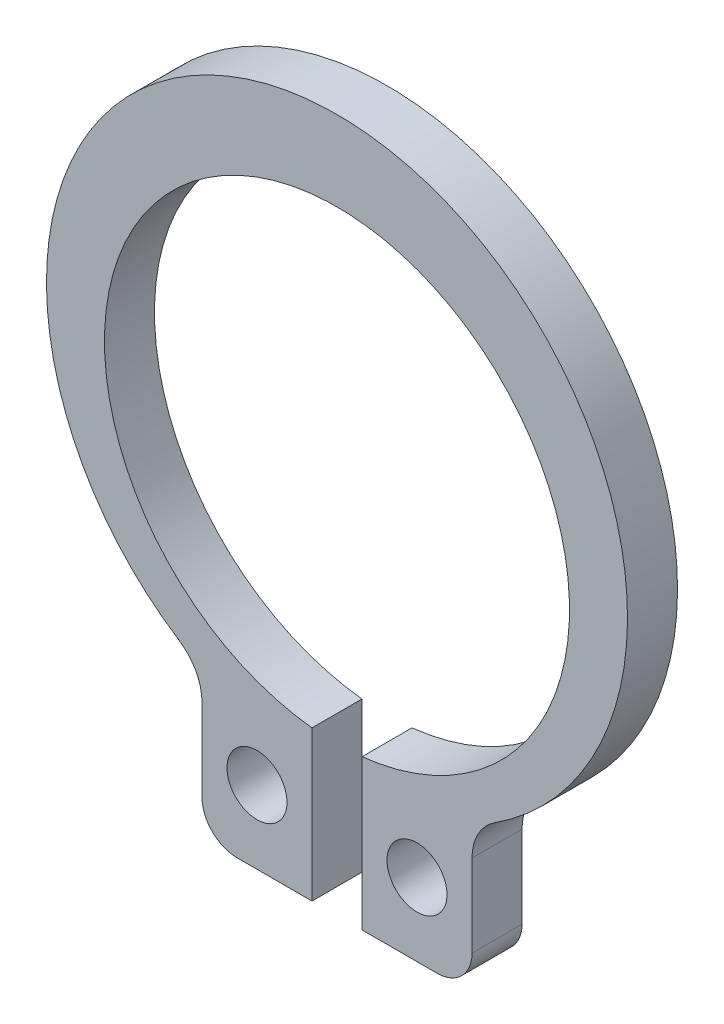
ISO-10303-21;
HEADER;
FILE_DESCRIPTION(('STEP AP214'),'2;1');
FILE_NAME('part.step','',(''),(''),'','','');
FILE_SCHEMA(('AUTOMOTIVE_DESIGN { 1 0 10303 214 1 1 1 1 }'));
ENDSEC;
DATA;
#1=APPLICATION_CONTEXT('core data for automotive mechanical design processes');
#2=APPLICATION_PROTOCOL_DEFINITION('international standard','automotive_design',2000,#1);
#3=PRODUCT_CONTEXT('',#1,'mechanical');
#4=PRODUCT('Part','Part','',(#3));
#5=PRODUCT_RELATED_PRODUCT_CATEGORY('part','',(#4));
#6=PRODUCT_DEFINITION_FORMATION('','',#4);
#7=PRODUCT_DEFINITION_CONTEXT('part definition',#1,'design');
#8=PRODUCT_DEFINITION('design','',#6,#7);
#9=PRODUCT_DEFINITION_SHAPE('','',#8);
#10=(LENGTH_UNIT() NAMED_UNIT(*) SI_UNIT(.MILLI.,.METRE.));
#11=(NAMED_UNIT(*) PLANE_ANGLE_UNIT() SI_UNIT($,.RADIAN.));
#12=(NAMED_UNIT(*) SI_UNIT($,.STERADIAN.) SOLID_ANGLE_UNIT());
#13=UNCERTAINTY_MEASURE_WITH_UNIT(LENGTH_MEASURE(1.E-05),#10,'distance_accuracy_value','');
#14=(GEOMETRIC_REPRESENTATION_CONTEXT(3) GLOBAL_UNCERTAINTY_ASSIGNED_CONTEXT((#13)) GLOBAL_UNIT_ASSIGNED_CONTEXT((#10,
#11,#12)) REPRESENTATION_CONTEXT('',''));
#15=CARTESIAN_POINT('',(0.,0.,0.));
#16=DIRECTION('',(0.,0.,1.));
#17=DIRECTION('',(1.,0.,0.));
#18=AXIS2_PLACEMENT_3D('',#15,#16,#17);
#19=CARTESIAN_POINT('',(0.,0.,1.));
#20=DIRECTION('',(0.,0.,1.));
#21=DIRECTION('',(1.,0.,0.));
#22=AXIS2_PLACEMENT_3D('',#19,#20,#21);
#23=PLANE('',#22);
#24=CARTESIAN_POINT('',(-1.6,-6.16378074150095,1.));
#25=DIRECTION('',(0.,0.,1.));
#26=DIRECTION('',(1.,0.,0.));
#27=AXIS2_PLACEMENT_3D('',#24,#25,#26);
#28=CIRCLE('',#27,0.6);
#29=CARTESIAN_POINT('',(-1.,-6.16378074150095,1.));
#30=VERTEX_POINT('',#29);
#31=EDGE_CURVE('E216',#30,#30,#28,.T.);
#32=ORIENTED_EDGE('',*,*,#31,.F.);
#33=EDGE_LOOP('',(#32));
#34=FACE_BOUND('',#33,.T.);
#35=DIRECTION('',(1.,0.,0.));
#36=VECTOR('',#35,1.);
#37=CARTESIAN_POINT('',(0.499999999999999,-7.62304012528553,1.));
#38=LINE('',#37,#36);
#39=CARTESIAN_POINT('',(0.499999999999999,-7.62304012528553,1.));
#40=VERTEX_POINT('',#39);
#41=CARTESIAN_POINT('',(2.,-7.62304012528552,1.));
#42=VERTEX_POINT('',#41);
#43=EDGE_CURVE('E132',#40,#42,#38,.T.);
#44=ORIENTED_EDGE('',*,*,#43,.T.);
#45=CARTESIAN_POINT('',(2.,-6.92304012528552,1.));
#46=DIRECTION('',(0.,0.,1.));
#47=DIRECTION('',(1.,0.,0.));
#48=AXIS2_PLACEMENT_3D('',#45,#46,#47);
#49=CIRCLE('',#48,0.7);
#50=CARTESIAN_POINT('',(2.7,-6.92304012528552,1.));
#51=VERTEX_POINT('',#50);
#52=EDGE_CURVE('E182',#42,#51,#49,.T.);
#53=ORIENTED_EDGE('',*,*,#52,.T.);
#54=DIRECTION('',(0.,1.,0.));
#55=VECTOR('',#54,1.);
#56=CARTESIAN_POINT('',(2.7,-7.62304012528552,1.));
#57=LINE('',#56,#55);
#58=CARTESIAN_POINT('',(2.7,-5.27717587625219,1.));
#59=VERTEX_POINT('',#58);
#60=EDGE_CURVE('E236',#51,#59,#57,.T.);
#61=ORIENTED_EDGE('',*,*,#60,.T.);
#62=CARTESIAN_POINT('',(3.7,-5.27717587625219,1.));
#63=DIRECTION('',(0.,0.,1.));
#64=DIRECTION('',(1.,0.,0.));
#65=AXIS2_PLACEMENT_3D('',#62,#63,#64);
#66=CIRCLE('',#65,1.);
#67=CARTESIAN_POINT('',(3.15668135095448,-4.43764931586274,1.));
#68=VERTEX_POINT('',#67);
#69=EDGE_CURVE('E166',#59,#68,#66,.F.);
#70=ORIENTED_EDGE('',*,*,#69,.T.);
#71=CARTESIAN_POINT('',(0.,0.439999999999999,1.));
#72=DIRECTION('',(0.,0.,1.));
#73=DIRECTION('',(1.,0.,0.));
#74=AXIS2_PLACEMENT_3D('',#71,#72,#73);
#75=CIRCLE('',#74,5.81);
#76=CARTESIAN_POINT('',(-3.15668135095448,-4.43764931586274,1.));
#77=VERTEX_POINT('',#76);
#78=EDGE_CURVE('E234',#68,#77,#75,.T.);
#79=ORIENTED_EDGE('',*,*,#78,.T.);
#80=CARTESIAN_POINT('',(-3.7,-5.27717587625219,1.));
#81=DIRECTION('',(0.,0.,1.));
#82=DIRECTION('',(1.,0.,0.));
#83=AXIS2_PLACEMENT_3D('',#80,#81,#82);
#84=CIRCLE('',#83,1.);
#85=CARTESIAN_POINT('',(-2.7,-5.27717587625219,1.));
#86=VERTEX_POINT('',#85);
#87=EDGE_CURVE('E170',#77,#86,#84,.F.);
#88=ORIENTED_EDGE('',*,*,#87,.T.);
#89=DIRECTION('',(0.,-1.,0.));
#90=VECTOR('',#89,1.);
#91=CARTESIAN_POINT('',(-2.7,-7.62304012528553,1.));
#92=LINE('',#91,#90);
#93=CARTESIAN_POINT('',(-2.7,-6.92304012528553,1.));
#94=VERTEX_POINT('',#93);
#95=EDGE_CURVE('E210',#86,#94,#92,.T.);
#96=ORIENTED_EDGE('',*,*,#95,.T.);
#97=CARTESIAN_POINT('',(-2.,-6.92304012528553,1.));
#98=DIRECTION('',(0.,0.,1.));
#99=DIRECTION('',(1.,0.,0.));
#100=AXIS2_PLACEMENT_3D('',#97,#98,#99);
#101=CIRCLE('',#100,0.7);
#102=CARTESIAN_POINT('',(-2.,-7.62304012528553,1.));
#103=VERTEX_POINT('',#102);
#104=EDGE_CURVE('E48',#94,#103,#101,.T.);
#105=ORIENTED_EDGE('',*,*,#104,.T.);
#106=DIRECTION('',(1.,0.,0.));
#107=VECTOR('',#106,1.);
#108=CARTESIAN_POINT('',(-0.499999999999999,-7.62304012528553,1.));
#109=LINE('',#108,#107);
#110=CARTESIAN_POINT('',(-0.499999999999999,-7.62304012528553,1.));
#111=VERTEX_POINT('',#110);
#112=EDGE_CURVE('E191',#103,#111,#109,.T.);
#113=ORIENTED_EDGE('',*,*,#112,.T.);
#114=DIRECTION('',(0.,1.,0.));
#115=VECTOR('',#114,1.);
#116=CARTESIAN_POINT('',(-0.499999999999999,-4.62304012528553,1.));
#117=LINE('',#116,#115);
#118=CARTESIAN_POINT('',(-0.499999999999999,-4.62304012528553,1.));
#119=VERTEX_POINT('',#118);
#120=EDGE_CURVE('E138',#111,#119,#117,.T.);
#121=ORIENTED_EDGE('',*,*,#120,.T.);
#122=CARTESIAN_POINT('',(0.,0.,1.));
#123=DIRECTION('',(0.,0.,-1.));
#124=DIRECTION('',(1.,0.,0.));
#125=AXIS2_PLACEMENT_3D('',#122,#123,#124);
#126=CIRCLE('',#125,4.65);
#127=CARTESIAN_POINT('',(0.499999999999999,-4.62304012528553,1.));
#128=VERTEX_POINT('',#127);
#129=EDGE_CURVE('E133',#119,#128,#126,.T.);
#130=ORIENTED_EDGE('',*,*,#129,.T.);
#131=DIRECTION('',(0.,-1.,0.));
#132=VECTOR('',#131,1.);
#133=CARTESIAN_POINT('',(0.499999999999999,-4.62304012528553,1.));
#134=LINE('',#133,#132);
#135=EDGE_CURVE('E122',#128,#40,#134,.T.);
#136=ORIENTED_EDGE('',*,*,#135,.T.);
#137=EDGE_LOOP('',(#44,#53,#61,#70,#79,#88,#96,#105,#113,#121,#130,#136));
#138=FACE_BOUND('',#137,.T.);
#139=CARTESIAN_POINT('',(1.6,-6.16378074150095,1.));
#140=DIRECTION('',(0.,0.,1.));
#141=DIRECTION('',(-1.,0.,0.));
#142=AXIS2_PLACEMENT_3D('',#139,#140,#141);
#143=CIRCLE('',#142,0.599999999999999);
#144=CARTESIAN_POINT('',(1.,-6.16378074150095,1.));
#145=VERTEX_POINT('',#144);
#146=EDGE_CURVE('E244',#145,#145,#143,.T.);
#147=ORIENTED_EDGE('',*,*,#146,.F.);
#148=EDGE_LOOP('',(#147));
#149=FACE_BOUND('',#148,.T.);
#150=ADVANCED_FACE('F33',(#34,#138,#149),#23,.T.);
#151=CARTESIAN_POINT('',(0.,0.,0.));
#152=DIRECTION('',(0.,0.,1.));
#153=DIRECTION('',(1.,0.,0.));
#154=AXIS2_PLACEMENT_3D('',#151,#152,#153);
#155=PLANE('',#154);
#156=DIRECTION('',(0.,1.,0.));
#157=VECTOR('',#156,1.);
#158=CARTESIAN_POINT('',(2.7,-7.62304012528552,0.));
#159=LINE('',#158,#157);
#160=CARTESIAN_POINT('',(2.7,-6.92304012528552,0.));
#161=VERTEX_POINT('',#160);
#162=CARTESIAN_POINT('',(2.7,-5.27717587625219,0.));
#163=VERTEX_POINT('',#162);
#164=EDGE_CURVE('E221',#161,#163,#159,.T.);
#165=ORIENTED_EDGE('',*,*,#164,.F.);
#166=CARTESIAN_POINT('',(2.,-6.92304012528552,0.));
#167=DIRECTION('',(0.,0.,1.));
#168=DIRECTION('',(1.,0.,0.));
#169=AXIS2_PLACEMENT_3D('',#166,#167,#168);
#170=CIRCLE('',#169,0.7);
#171=CARTESIAN_POINT('',(2.,-7.62304012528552,0.));
#172=VERTEX_POINT('',#171);
#173=EDGE_CURVE('E177',#161,#172,#170,.F.);
#174=ORIENTED_EDGE('',*,*,#173,.T.);
#175=DIRECTION('',(1.,0.,0.));
#176=VECTOR('',#175,1.);
#177=CARTESIAN_POINT('',(0.499999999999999,-7.62304012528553,0.));
#178=LINE('',#177,#176);
#179=CARTESIAN_POINT('',(0.499999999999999,-7.62304012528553,0.));
#180=VERTEX_POINT('',#179);
#181=EDGE_CURVE('E218',#180,#172,#178,.T.);
#182=ORIENTED_EDGE('',*,*,#181,.F.);
#183=DIRECTION('',(0.,-1.,0.));
#184=VECTOR('',#183,1.);
#185=CARTESIAN_POINT('',(0.499999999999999,-4.62304012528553,0.));
#186=LINE('',#185,#184);
#187=CARTESIAN_POINT('',(0.499999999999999,-4.62304012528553,0.));
#188=VERTEX_POINT('',#187);
#189=EDGE_CURVE('E215',#188,#180,#186,.T.);
#190=ORIENTED_EDGE('',*,*,#189,.F.);
#191=CARTESIAN_POINT('',(0.,0.,0.));
#192=DIRECTION('',(0.,0.,-1.));
#193=DIRECTION('',(1.,0.,0.));
#194=AXIS2_PLACEMENT_3D('',#191,#192,#193);
#195=CIRCLE('',#194,4.65);
#196=CARTESIAN_POINT('',(-0.499999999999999,-4.62304012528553,0.));
#197=VERTEX_POINT('',#196);
#198=EDGE_CURVE('E146',#197,#188,#195,.T.);
#199=ORIENTED_EDGE('',*,*,#198,.F.);
#200=DIRECTION('',(0.,1.,0.));
#201=VECTOR('',#200,1.);
#202=CARTESIAN_POINT('',(-0.499999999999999,-4.62304012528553,0.));
#203=LINE('',#202,#201);
#204=CARTESIAN_POINT('',(-0.499999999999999,-7.62304012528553,0.));
#205=VERTEX_POINT('',#204);
#206=EDGE_CURVE('E142',#205,#197,#203,.T.);
#207=ORIENTED_EDGE('',*,*,#206,.F.);
#208=DIRECTION('',(1.,0.,0.));
#209=VECTOR('',#208,1.);
#210=CARTESIAN_POINT('',(-0.499999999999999,-7.62304012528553,0.));
#211=LINE('',#210,#209);
#212=CARTESIAN_POINT('',(-2.,-7.62304012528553,0.));
#213=VERTEX_POINT('',#212);
#214=EDGE_CURVE('E189',#213,#205,#211,.T.);
#215=ORIENTED_EDGE('',*,*,#214,.F.);
#216=CARTESIAN_POINT('',(-2.,-6.92304012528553,0.));
#217=DIRECTION('',(0.,0.,1.));
#218=DIRECTION('',(1.,0.,0.));
#219=AXIS2_PLACEMENT_3D('',#216,#217,#218);
#220=CIRCLE('',#219,0.7);
#221=CARTESIAN_POINT('',(-2.7,-6.92304012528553,0.));
#222=VERTEX_POINT('',#221);
#223=EDGE_CURVE('E175',#213,#222,#220,.F.);
#224=ORIENTED_EDGE('',*,*,#223,.T.);
#225=DIRECTION('',(0.,-1.,0.));
#226=VECTOR('',#225,1.);
#227=CARTESIAN_POINT('',(-2.7,-7.62304012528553,0.));
#228=LINE('',#227,#226);
#229=CARTESIAN_POINT('',(-2.7,-5.27717587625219,0.));
#230=VERTEX_POINT('',#229);
#231=EDGE_CURVE('E199',#230,#222,#228,.T.);
#232=ORIENTED_EDGE('',*,*,#231,.F.);
#233=CARTESIAN_POINT('',(-3.7,-5.27717587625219,0.));
#234=DIRECTION('',(0.,0.,1.));
#235=DIRECTION('',(1.,0.,0.));
#236=AXIS2_PLACEMENT_3D('',#233,#234,#235);
#237=CIRCLE('',#236,1.);
#238=CARTESIAN_POINT('',(-3.15668135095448,-4.43764931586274,0.));
#239=VERTEX_POINT('',#238);
#240=EDGE_CURVE('E168',#230,#239,#237,.T.);
#241=ORIENTED_EDGE('',*,*,#240,.T.);
#242=CARTESIAN_POINT('',(0.,0.439999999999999,0.));
#243=DIRECTION('',(0.,0.,1.));
#244=DIRECTION('',(1.,0.,0.));
#245=AXIS2_PLACEMENT_3D('',#242,#243,#244);
#246=CIRCLE('',#245,5.81);
#247=CARTESIAN_POINT('',(3.15668135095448,-4.43764931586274,0.));
#248=VERTEX_POINT('',#247);
#249=EDGE_CURVE('E202',#248,#239,#246,.T.);
#250=ORIENTED_EDGE('',*,*,#249,.F.);
#251=CARTESIAN_POINT('',(3.7,-5.27717587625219,0.));
#252=DIRECTION('',(0.,0.,1.));
#253=DIRECTION('',(1.,0.,0.));
#254=AXIS2_PLACEMENT_3D('',#251,#252,#253);
#255=CIRCLE('',#254,1.);
#256=EDGE_CURVE('E163',#248,#163,#255,.T.);
#257=ORIENTED_EDGE('',*,*,#256,.T.);
#258=EDGE_LOOP('',(#165,#174,#182,#190,#199,#207,#215,#224,#232,#241,#250,#257));
#259=FACE_BOUND('',#258,.T.);
#260=CARTESIAN_POINT('',(-1.6,-6.16378074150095,0.));
#261=DIRECTION('',(0.,0.,1.));
#262=DIRECTION('',(1.,0.,0.));
#263=AXIS2_PLACEMENT_3D('',#260,#261,#262);
#264=CIRCLE('',#263,0.6);
#265=CARTESIAN_POINT('',(-1.,-6.16378074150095,0.));
#266=VERTEX_POINT('',#265);
#267=EDGE_CURVE('E241',#266,#266,#264,.T.);
#268=ORIENTED_EDGE('',*,*,#267,.T.);
#269=EDGE_LOOP('',(#268));
#270=FACE_BOUND('',#269,.T.);
#271=CARTESIAN_POINT('',(1.6,-6.16378074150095,0.));
#272=DIRECTION('',(0.,0.,1.));
#273=DIRECTION('',(-1.,0.,0.));
#274=AXIS2_PLACEMENT_3D('',#271,#272,#273);
#275=CIRCLE('',#274,0.599999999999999);
#276=CARTESIAN_POINT('',(1.,-6.16378074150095,0.));
#277=VERTEX_POINT('',#276);
#278=EDGE_CURVE('E247',#277,#277,#275,.T.);
#279=ORIENTED_EDGE('',*,*,#278,.T.);
#280=EDGE_LOOP('',(#279));
#281=FACE_BOUND('',#280,.T.);
#282=ADVANCED_FACE('F196',(#259,#270,#281),#155,.F.);
#283=CARTESIAN_POINT('',(0.,0.,1.));
#284=DIRECTION('',(0.,0.,-1.));
#285=DIRECTION('',(-1.,0.,0.));
#286=AXIS2_PLACEMENT_3D('',#283,#284,#285);
#287=CYLINDRICAL_SURFACE('',#286,4.65);
#288=ORIENTED_EDGE('',*,*,#198,.T.);
#289=DIRECTION('',(0.,0.,-1.));
#290=VECTOR('',#289,1.);
#291=CARTESIAN_POINT('',(0.499999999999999,-4.62304012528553,1.));
#292=LINE('',#291,#290);
#293=EDGE_CURVE('E126',#128,#188,#292,.T.);
#294=ORIENTED_EDGE('',*,*,#293,.F.);
#295=ORIENTED_EDGE('',*,*,#129,.F.);
#296=DIRECTION('',(0.,0.,-1.));
#297=VECTOR('',#296,1.);
#298=CARTESIAN_POINT('',(-0.499999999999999,-4.62304012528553,1.));
#299=LINE('',#298,#297);
#300=EDGE_CURVE('E206',#119,#197,#299,.T.);
#301=ORIENTED_EDGE('',*,*,#300,.T.);
#302=EDGE_LOOP('',(#288,#294,#295,#301));
#303=FACE_BOUND('',#302,.T.);
#304=ADVANCED_FACE('F144',(#303),#287,.F.);
#305=CARTESIAN_POINT('',(0.499999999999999,-4.62304012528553,1.));
#306=DIRECTION('',(1.,0.,0.));
#307=DIRECTION('',(0.,1.,0.));
#308=AXIS2_PLACEMENT_3D('',#305,#306,#307);
#309=PLANE('',#308);
#310=ORIENTED_EDGE('',*,*,#189,.T.);
#311=DIRECTION('',(0.,0.,-1.));
#312=VECTOR('',#311,1.);
#313=CARTESIAN_POINT('',(0.499999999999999,-7.62304012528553,1.));
#314=LINE('',#313,#312);
#315=EDGE_CURVE('E129',#40,#180,#314,.T.);
#316=ORIENTED_EDGE('',*,*,#315,.F.);
#317=ORIENTED_EDGE('',*,*,#135,.F.);
#318=ORIENTED_EDGE('',*,*,#293,.T.);
#319=EDGE_LOOP('',(#310,#316,#317,#318));
#320=FACE_BOUND('',#319,.T.);
#321=ADVANCED_FACE('F124',(#320),#309,.F.);
#322=CARTESIAN_POINT('',(0.499999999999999,-7.62304012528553,1.));
#323=DIRECTION('',(0.,1.,0.));
#324=DIRECTION('',(-1.,0.,0.));
#325=AXIS2_PLACEMENT_3D('',#322,#323,#324);
#326=PLANE('',#325);
#327=ORIENTED_EDGE('',*,*,#181,.T.);
#328=DIRECTION('',(0.,0.,-1.));
#329=VECTOR('',#328,1.);
#330=CARTESIAN_POINT('',(2.,-7.62304012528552,1.));
#331=LINE('',#330,#329);
#332=EDGE_CURVE('E179',#172,#42,#331,.F.);
#333=ORIENTED_EDGE('',*,*,#332,.T.);
#334=ORIENTED_EDGE('',*,*,#43,.F.);
#335=ORIENTED_EDGE('',*,*,#315,.T.);
#336=EDGE_LOOP('',(#327,#333,#334,#335));
#337=FACE_BOUND('',#336,.T.);
#338=ADVANCED_FACE('F278',(#337),#326,.F.);
#339=CARTESIAN_POINT('',(2.7,-7.62304012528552,1.));
#340=DIRECTION('',(-1.,0.,0.));
#341=DIRECTION('',(0.,-1.,0.));
#342=AXIS2_PLACEMENT_3D('',#339,#340,#341);
#343=PLANE('',#342);
#344=ORIENTED_EDGE('',*,*,#60,.F.);
#345=DIRECTION('',(0.,0.,-1.));
#346=VECTOR('',#345,1.);
#347=CARTESIAN_POINT('',(2.7,-6.92304012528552,1.));
#348=LINE('',#347,#346);
#349=EDGE_CURVE('E172',#51,#161,#348,.T.);
#350=ORIENTED_EDGE('',*,*,#349,.T.);
#351=ORIENTED_EDGE('',*,*,#164,.T.);
#352=DIRECTION('',(0.,0.,1.));
#353=VECTOR('',#352,1.);
#354=CARTESIAN_POINT('',(2.7,-5.27717587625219,1.));
#355=LINE('',#354,#353);
#356=EDGE_CURVE('E157',#163,#59,#355,.T.);
#357=ORIENTED_EDGE('',*,*,#356,.T.);
#358=EDGE_LOOP('',(#344,#350,#351,#357));
#359=FACE_BOUND('',#358,.T.);
#360=ADVANCED_FACE('F275',(#359),#343,.F.);
#361=CARTESIAN_POINT('',(0.,0.439999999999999,1.));
#362=DIRECTION('',(0.,0.,-1.));
#363=DIRECTION('',(-1.,0.,0.));
#364=AXIS2_PLACEMENT_3D('',#361,#362,#363);
#365=CYLINDRICAL_SURFACE('',#364,5.81);
#366=ORIENTED_EDGE('',*,*,#78,.F.);
#367=DIRECTION('',(0.,0.,-1.));
#368=VECTOR('',#367,1.);
#369=CARTESIAN_POINT('',(3.15668135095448,-4.43764931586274,1.));
#370=LINE('',#369,#368);
#371=EDGE_CURVE('E149',#68,#248,#370,.T.);
#372=ORIENTED_EDGE('',*,*,#371,.T.);
#373=ORIENTED_EDGE('',*,*,#249,.T.);
#374=DIRECTION('',(0.,0.,-1.));
#375=VECTOR('',#374,1.);
#376=CARTESIAN_POINT('',(-3.15668135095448,-4.43764931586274,1.));
#377=LINE('',#376,#375);
#378=EDGE_CURVE('E147',#239,#77,#377,.F.);
#379=ORIENTED_EDGE('',*,*,#378,.T.);
#380=EDGE_LOOP('',(#366,#372,#373,#379));
#381=FACE_BOUND('',#380,.T.);
#382=ADVANCED_FACE('F227',(#381),#365,.T.);
#383=CARTESIAN_POINT('',(-2.7,-7.62304012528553,1.));
#384=DIRECTION('',(1.,0.,0.));
#385=DIRECTION('',(0.,1.,0.));
#386=AXIS2_PLACEMENT_3D('',#383,#384,#385);
#387=PLANE('',#386);
#388=ORIENTED_EDGE('',*,*,#231,.T.);
#389=DIRECTION('',(0.,0.,-1.));
#390=VECTOR('',#389,1.);
#391=CARTESIAN_POINT('',(-2.7,-6.92304012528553,1.));
#392=LINE('',#391,#390);
#393=EDGE_CURVE('E11',#222,#94,#392,.F.);
#394=ORIENTED_EDGE('',*,*,#393,.T.);
#395=ORIENTED_EDGE('',*,*,#95,.F.);
#396=DIRECTION('',(0.,0.,1.));
#397=VECTOR('',#396,1.);
#398=CARTESIAN_POINT('',(-2.7,-5.27717587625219,0.));
#399=LINE('',#398,#397);
#400=EDGE_CURVE('E160',#86,#230,#399,.F.);
#401=ORIENTED_EDGE('',*,*,#400,.T.);
#402=EDGE_LOOP('',(#388,#394,#395,#401));
#403=FACE_BOUND('',#402,.T.);
#404=ADVANCED_FACE('F235',(#403),#387,.F.);
#405=CARTESIAN_POINT('',(-0.499999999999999,-7.62304012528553,1.));
#406=DIRECTION('',(0.,1.,0.));
#407=DIRECTION('',(0.,0.,1.));
#408=AXIS2_PLACEMENT_3D('',#405,#406,#407);
#409=PLANE('',#408);
#410=ORIENTED_EDGE('',*,*,#112,.F.);
#411=DIRECTION('',(0.,0.,-1.));
#412=VECTOR('',#411,1.);
#413=CARTESIAN_POINT('',(-2.,-7.62304012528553,1.));
#414=LINE('',#413,#412);
#415=EDGE_CURVE('E41',#103,#213,#414,.T.);
#416=ORIENTED_EDGE('',*,*,#415,.T.);
#417=ORIENTED_EDGE('',*,*,#214,.T.);
#418=DIRECTION('',(0.,0.,-1.));
#419=VECTOR('',#418,1.);
#420=CARTESIAN_POINT('',(-0.499999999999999,-7.62304012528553,1.));
#421=LINE('',#420,#419);
#422=EDGE_CURVE('E151',#111,#205,#421,.T.);
#423=ORIENTED_EDGE('',*,*,#422,.F.);
#424=EDGE_LOOP('',(#410,#416,#417,#423));
#425=FACE_BOUND('',#424,.T.);
#426=ADVANCED_FACE('F187',(#425),#409,.F.);
#427=CARTESIAN_POINT('',(-0.499999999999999,-4.62304012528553,1.));
#428=DIRECTION('',(-1.,0.,0.));
#429=DIRECTION('',(0.,-1.,0.));
#430=AXIS2_PLACEMENT_3D('',#427,#428,#429);
#431=PLANE('',#430);
#432=ORIENTED_EDGE('',*,*,#206,.T.);
#433=ORIENTED_EDGE('',*,*,#300,.F.);
#434=ORIENTED_EDGE('',*,*,#120,.F.);
#435=ORIENTED_EDGE('',*,*,#422,.T.);
#436=EDGE_LOOP('',(#432,#433,#434,#435));
#437=FACE_BOUND('',#436,.T.);
#438=ADVANCED_FACE('F208',(#437),#431,.F.);
#439=CARTESIAN_POINT('',(-1.6,-6.16378074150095,1.));
#440=DIRECTION('',(0.,0.,-1.));
#441=DIRECTION('',(-1.,0.,0.));
#442=AXIS2_PLACEMENT_3D('',#439,#440,#441);
#443=CYLINDRICAL_SURFACE('',#442,0.6);
#444=ORIENTED_EDGE('',*,*,#31,.T.);
#445=EDGE_LOOP('',(#444));
#446=FACE_BOUND('',#445,.T.);
#447=ORIENTED_EDGE('',*,*,#267,.F.);
#448=EDGE_LOOP('',(#447));
#449=FACE_BOUND('',#448,.T.);
#450=ADVANCED_FACE('F264',(#446,#449),#443,.F.);
#451=CARTESIAN_POINT('',(1.6,-6.16378074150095,1.));
#452=DIRECTION('',(0.,0.,-1.));
#453=DIRECTION('',(-1.,0.,0.));
#454=AXIS2_PLACEMENT_3D('',#451,#452,#453);
#455=CYLINDRICAL_SURFACE('',#454,0.599999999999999);
#456=ORIENTED_EDGE('',*,*,#146,.T.);
#457=EDGE_LOOP('',(#456));
#458=FACE_BOUND('',#457,.T.);
#459=ORIENTED_EDGE('',*,*,#278,.F.);
#460=EDGE_LOOP('',(#459));
#461=FACE_BOUND('',#460,.T.);
#462=ADVANCED_FACE('F253',(#458,#461),#455,.F.);
#463=CARTESIAN_POINT('',(3.7,-5.27717587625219,1.));
#464=DIRECTION('',(0.,0.,-1.));
#465=DIRECTION('',(-1.,0.,0.));
#466=AXIS2_PLACEMENT_3D('',#463,#464,#465);
#467=CYLINDRICAL_SURFACE('',#466,1.);
#468=ORIENTED_EDGE('',*,*,#69,.F.);
#469=ORIENTED_EDGE('',*,*,#356,.F.);
#470=ORIENTED_EDGE('',*,*,#256,.F.);
#471=ORIENTED_EDGE('',*,*,#371,.F.);
#472=EDGE_LOOP('',(#468,#469,#470,#471));
#473=FACE_BOUND('',#472,.T.);
#474=ADVANCED_FACE('F287',(#473),#467,.F.);
#475=CARTESIAN_POINT('',(-3.7,-5.27717587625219,1.));
#476=DIRECTION('',(0.,0.,-1.));
#477=DIRECTION('',(-1.,0.,0.));
#478=AXIS2_PLACEMENT_3D('',#475,#476,#477);
#479=CYLINDRICAL_SURFACE('',#478,1.);
#480=ORIENTED_EDGE('',*,*,#87,.F.);
#481=ORIENTED_EDGE('',*,*,#378,.F.);
#482=ORIENTED_EDGE('',*,*,#240,.F.);
#483=ORIENTED_EDGE('',*,*,#400,.F.);
#484=EDGE_LOOP('',(#480,#481,#482,#483));
#485=FACE_BOUND('',#484,.T.);
#486=ADVANCED_FACE('F232',(#485),#479,.F.);
#487=CARTESIAN_POINT('',(2.,-6.92304012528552,1.));
#488=DIRECTION('',(0.,0.,-1.));
#489=DIRECTION('',(-1.,0.,0.));
#490=AXIS2_PLACEMENT_3D('',#487,#488,#489);
#491=CYLINDRICAL_SURFACE('',#490,0.7);
#492=ORIENTED_EDGE('',*,*,#52,.F.);
#493=ORIENTED_EDGE('',*,*,#332,.F.);
#494=ORIENTED_EDGE('',*,*,#173,.F.);
#495=ORIENTED_EDGE('',*,*,#349,.F.);
#496=EDGE_LOOP('',(#492,#493,#494,#495));
#497=FACE_BOUND('',#496,.T.);
#498=ADVANCED_FACE('F292',(#497),#491,.T.);
#499=CARTESIAN_POINT('',(-2.,-6.92304012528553,1.));
#500=DIRECTION('',(0.,0.,-1.));
#501=DIRECTION('',(-1.,0.,0.));
#502=AXIS2_PLACEMENT_3D('',#499,#500,#501);
#503=CYLINDRICAL_SURFACE('',#502,0.7);
#504=ORIENTED_EDGE('',*,*,#104,.F.);
#505=ORIENTED_EDGE('',*,*,#393,.F.);
#506=ORIENTED_EDGE('',*,*,#223,.F.);
#507=ORIENTED_EDGE('',*,*,#415,.F.);
#508=EDGE_LOOP('',(#504,#505,#506,#507));
#509=FACE_BOUND('',#508,.T.);
#510=ADVANCED_FACE('F35',(#509),#503,.T.);
#511=CLOSED_SHELL('',(#150,#282,#304,#321,#338,#360,#382,#404,#426,#438,#450,#462,#474,#486,
#498,#510));
#512=MANIFOLD_SOLID_BREP('B2',#511);
#513=ADVANCED_BREP_SHAPE_REPRESENTATION('',(#18,#512),#14);
#514=SHAPE_DEFINITION_REPRESENTATION(#9,#513);
ENDSEC;
END-ISO-10303-21;
